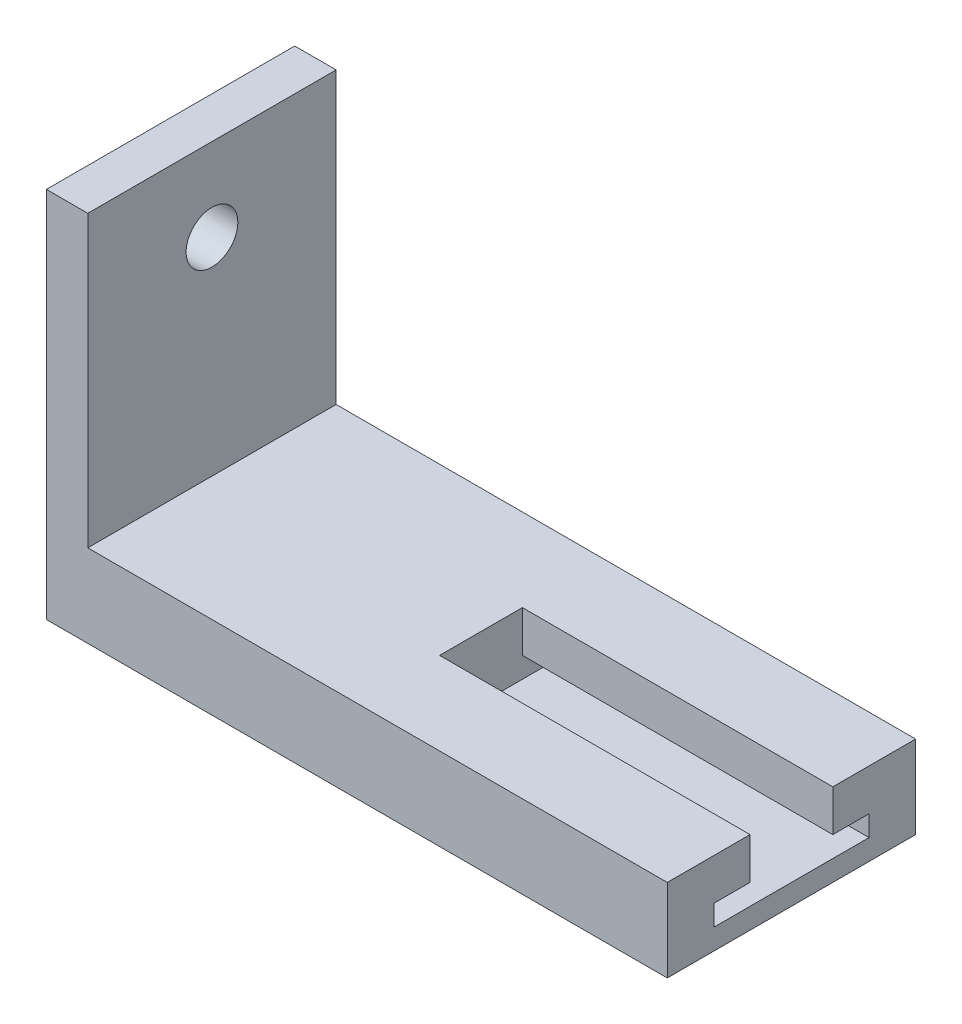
from build123d import *

# Parameters (mm, degrees)
BASE_EXTRUDE_DEPTH = 60
CUT_EXTRUDE1_DEPTH = 150
SKETCH3_R          = 12.5
CUT_EXTRUDE2_DEPTH = 339.230690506


with BuildPart() as part:
    # Sketch1 → Base-Extrude (new, symmetric)
    with BuildSketch(Plane.XY):
        Polygon((0, 0), (0, 40), (-280, 40), (-280, 180), (-300, 180), (-300, 0), align=None)
    extrude(amount=BASE_EXTRUDE_DEPTH, both=True)

    # Sketch2 → Cut-Extrude1 (cut)
    with BuildSketch(Plane(origin=(0, 0, 0), x_dir=(0, 0, -1), z_dir=(1, 0, 0))):
        Polygon((20, 40), (20, 20), (37.5, 20), (37.5, 10), (-37.5, 10), (-37.5, 20), (-20, 20), (-20, 40), align=None)
    extrude(amount=-CUT_EXTRUDE1_DEPTH, mode=Mode.SUBTRACT)

    # Sketch3 → Cut-Extrude2 (cut, through all)
    with BuildSketch(Plane(origin=(-280, 0, 0), x_dir=(0, 0, -1), z_dir=(1, 0, 0))):
        with Locations(Location((0, 140, 0), (0, 0, 90))):
            Circle(SKETCH3_R)
    extrude(amount=-CUT_EXTRUDE2_DEPTH, mode=Mode.SUBTRACT)


solid = part.part
